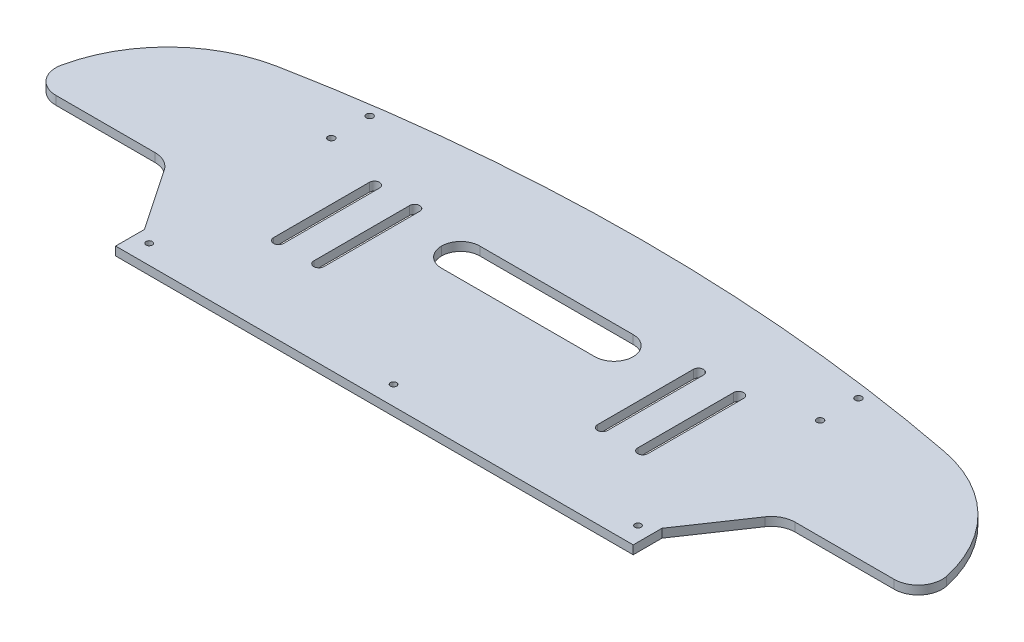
ISO-10303-21;
HEADER;
FILE_DESCRIPTION(('STEP AP214'),'2;1');
FILE_NAME('part.step','',(''),(''),'','','');
FILE_SCHEMA(('AUTOMOTIVE_DESIGN { 1 0 10303 214 1 1 1 1 }'));
ENDSEC;
DATA;
#1=APPLICATION_CONTEXT('core data for automotive mechanical design processes');
#2=APPLICATION_PROTOCOL_DEFINITION('international standard','automotive_design',2000,#1);
#3=PRODUCT_CONTEXT('',#1,'mechanical');
#4=PRODUCT('Part','Part','',(#3));
#5=PRODUCT_RELATED_PRODUCT_CATEGORY('part','',(#4));
#6=PRODUCT_DEFINITION_FORMATION('','',#4);
#7=PRODUCT_DEFINITION_CONTEXT('part definition',#1,'design');
#8=PRODUCT_DEFINITION('design','',#6,#7);
#9=PRODUCT_DEFINITION_SHAPE('','',#8);
#10=(LENGTH_UNIT() NAMED_UNIT(*) SI_UNIT(.MILLI.,.METRE.));
#11=(NAMED_UNIT(*) PLANE_ANGLE_UNIT() SI_UNIT($,.RADIAN.));
#12=(NAMED_UNIT(*) SI_UNIT($,.STERADIAN.) SOLID_ANGLE_UNIT());
#13=UNCERTAINTY_MEASURE_WITH_UNIT(LENGTH_MEASURE(1.E-05),#10,'distance_accuracy_value','');
#14=(GEOMETRIC_REPRESENTATION_CONTEXT(3) GLOBAL_UNCERTAINTY_ASSIGNED_CONTEXT((#13)) GLOBAL_UNIT_ASSIGNED_CONTEXT((#10,
#11,#12)) REPRESENTATION_CONTEXT('',''));
#15=CARTESIAN_POINT('',(0.,0.,0.));
#16=DIRECTION('',(0.,0.,1.));
#17=DIRECTION('',(1.,0.,0.));
#18=AXIS2_PLACEMENT_3D('',#15,#16,#17);
#19=CARTESIAN_POINT('',(-190.,9.,-220.));
#20=DIRECTION('',(0.,-1.,0.));
#21=DIRECTION('',(0.,0.,-1.));
#22=AXIS2_PLACEMENT_3D('',#19,#20,#21);
#23=CYLINDRICAL_SURFACE('',#22,5.24999999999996);
#24=CARTESIAN_POINT('',(-190.,0.,-220.));
#25=DIRECTION('',(0.,1.,0.));
#26=DIRECTION('',(0.,0.,1.));
#27=AXIS2_PLACEMENT_3D('',#24,#25,#26);
#28=CIRCLE('',#27,5.24999999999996);
#29=CARTESIAN_POINT('',(-195.25,0.,-220.));
#30=VERTEX_POINT('',#29);
#31=CARTESIAN_POINT('',(-184.75,0.,-220.));
#32=VERTEX_POINT('',#31);
#33=EDGE_CURVE('E572',#30,#32,#28,.T.);
#34=ORIENTED_EDGE('',*,*,#33,.F.);
#35=DIRECTION('',(0.,-1.,0.));
#36=VECTOR('',#35,1.);
#37=CARTESIAN_POINT('',(-195.25,9.,-220.));
#38=LINE('',#37,#36);
#39=CARTESIAN_POINT('',(-195.25,9.,-220.));
#40=VERTEX_POINT('',#39);
#41=EDGE_CURVE('E605',#40,#30,#38,.T.);
#42=ORIENTED_EDGE('',*,*,#41,.F.);
#43=CARTESIAN_POINT('',(-190.,9.,-220.));
#44=DIRECTION('',(0.,1.,0.));
#45=DIRECTION('',(0.,0.,1.));
#46=AXIS2_PLACEMENT_3D('',#43,#44,#45);
#47=CIRCLE('',#46,5.24999999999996);
#48=CARTESIAN_POINT('',(-184.75,9.,-220.));
#49=VERTEX_POINT('',#48);
#50=EDGE_CURVE('E496',#40,#49,#47,.T.);
#51=ORIENTED_EDGE('',*,*,#50,.T.);
#52=DIRECTION('',(0.,-1.,0.));
#53=VECTOR('',#52,1.);
#54=CARTESIAN_POINT('',(-184.75,9.,-220.));
#55=LINE('',#54,#53);
#56=EDGE_CURVE('E595',#49,#32,#55,.T.);
#57=ORIENTED_EDGE('',*,*,#56,.T.);
#58=EDGE_LOOP('',(#34,#42,#51,#57));
#59=FACE_BOUND('',#58,.T.);
#60=ADVANCED_FACE('F47',(#59),#23,.F.);
#61=CARTESIAN_POINT('',(-195.25,9.,1.08385522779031E-13));
#62=DIRECTION('',(1.,0.,0.));
#63=DIRECTION('',(0.,0.,-1.));
#64=AXIS2_PLACEMENT_3D('',#61,#62,#63);
#65=PLANE('',#64);
#66=DIRECTION('',(0.,0.,1.));
#67=VECTOR('',#66,1.);
#68=CARTESIAN_POINT('',(-195.25,0.,1.08385522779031E-13));
#69=LINE('',#68,#67);
#70=CARTESIAN_POINT('',(-195.25,0.,-320.));
#71=VERTEX_POINT('',#70);
#72=EDGE_CURVE('E576',#71,#30,#69,.T.);
#73=ORIENTED_EDGE('',*,*,#72,.F.);
#74=DIRECTION('',(0.,-1.,0.));
#75=VECTOR('',#74,1.);
#76=CARTESIAN_POINT('',(-195.25,9.,-320.));
#77=LINE('',#76,#75);
#78=CARTESIAN_POINT('',(-195.25,9.,-320.));
#79=VERTEX_POINT('',#78);
#80=EDGE_CURVE('E602',#79,#71,#77,.T.);
#81=ORIENTED_EDGE('',*,*,#80,.F.);
#82=DIRECTION('',(0.,0.,1.));
#83=VECTOR('',#82,1.);
#84=CARTESIAN_POINT('',(-195.25,9.,1.08385522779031E-13));
#85=LINE('',#84,#83);
#86=EDGE_CURVE('E500',#79,#40,#85,.T.);
#87=ORIENTED_EDGE('',*,*,#86,.T.);
#88=ORIENTED_EDGE('',*,*,#41,.T.);
#89=EDGE_LOOP('',(#73,#81,#87,#88));
#90=FACE_BOUND('',#89,.T.);
#91=ADVANCED_FACE('F775',(#90),#65,.T.);
#92=CARTESIAN_POINT('',(-190.,9.,-320.));
#93=DIRECTION('',(0.,-1.,0.));
#94=DIRECTION('',(0.,0.,-1.));
#95=AXIS2_PLACEMENT_3D('',#92,#93,#94);
#96=CYLINDRICAL_SURFACE('',#95,5.25);
#97=CARTESIAN_POINT('',(-190.,0.,-320.));
#98=DIRECTION('',(0.,1.,0.));
#99=DIRECTION('',(0.,0.,1.));
#100=AXIS2_PLACEMENT_3D('',#97,#98,#99);
#101=CIRCLE('',#100,5.25);
#102=CARTESIAN_POINT('',(-184.75,0.,-320.));
#103=VERTEX_POINT('',#102);
#104=EDGE_CURVE('E580',#103,#71,#101,.T.);
#105=ORIENTED_EDGE('',*,*,#104,.F.);
#106=DIRECTION('',(0.,-1.,0.));
#107=VECTOR('',#106,1.);
#108=CARTESIAN_POINT('',(-184.75,9.,-320.));
#109=LINE('',#108,#107);
#110=CARTESIAN_POINT('',(-184.75,9.,-320.));
#111=VERTEX_POINT('',#110);
#112=EDGE_CURVE('E598',#111,#103,#109,.T.);
#113=ORIENTED_EDGE('',*,*,#112,.F.);
#114=CARTESIAN_POINT('',(-190.,9.,-320.));
#115=DIRECTION('',(0.,1.,0.));
#116=DIRECTION('',(0.,0.,1.));
#117=AXIS2_PLACEMENT_3D('',#114,#115,#116);
#118=CIRCLE('',#117,5.25);
#119=EDGE_CURVE('E504',#111,#79,#118,.T.);
#120=ORIENTED_EDGE('',*,*,#119,.T.);
#121=ORIENTED_EDGE('',*,*,#80,.T.);
#122=EDGE_LOOP('',(#105,#113,#120,#121));
#123=FACE_BOUND('',#122,.T.);
#124=ADVANCED_FACE('F781',(#123),#96,.F.);
#125=CARTESIAN_POINT('',(-148.,9.,-220.));
#126=DIRECTION('',(0.,-1.,0.));
#127=DIRECTION('',(0.,0.,-1.));
#128=AXIS2_PLACEMENT_3D('',#125,#126,#127);
#129=CYLINDRICAL_SURFACE('',#128,5.24999999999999);
#130=CARTESIAN_POINT('',(-148.,0.,-220.));
#131=DIRECTION('',(0.,1.,0.));
#132=DIRECTION('',(0.,0.,1.));
#133=AXIS2_PLACEMENT_3D('',#130,#131,#132);
#134=CIRCLE('',#133,5.24999999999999);
#135=CARTESIAN_POINT('',(-153.25,0.,-220.));
#136=VERTEX_POINT('',#135);
#137=CARTESIAN_POINT('',(-142.75,0.,-220.));
#138=VERTEX_POINT('',#137);
#139=EDGE_CURVE('E556',#136,#138,#134,.T.);
#140=ORIENTED_EDGE('',*,*,#139,.F.);
#141=DIRECTION('',(0.,-1.,0.));
#142=VECTOR('',#141,1.);
#143=CARTESIAN_POINT('',(-153.25,9.,-220.));
#144=LINE('',#143,#142);
#145=CARTESIAN_POINT('',(-153.25,9.,-220.));
#146=VERTEX_POINT('',#145);
#147=EDGE_CURVE('E599',#146,#136,#144,.T.);
#148=ORIENTED_EDGE('',*,*,#147,.F.);
#149=CARTESIAN_POINT('',(-148.,9.,-220.));
#150=DIRECTION('',(0.,1.,0.));
#151=DIRECTION('',(0.,0.,1.));
#152=AXIS2_PLACEMENT_3D('',#149,#150,#151);
#153=CIRCLE('',#152,5.24999999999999);
#154=CARTESIAN_POINT('',(-142.75,9.,-220.));
#155=VERTEX_POINT('',#154);
#156=EDGE_CURVE('E481',#146,#155,#153,.T.);
#157=ORIENTED_EDGE('',*,*,#156,.T.);
#158=DIRECTION('',(0.,-1.,0.));
#159=VECTOR('',#158,1.);
#160=CARTESIAN_POINT('',(-142.75,9.,-220.));
#161=LINE('',#160,#159);
#162=EDGE_CURVE('E609',#155,#138,#161,.T.);
#163=ORIENTED_EDGE('',*,*,#162,.T.);
#164=EDGE_LOOP('',(#140,#148,#157,#163));
#165=FACE_BOUND('',#164,.T.);
#166=ADVANCED_FACE('F799',(#165),#129,.F.);
#167=CARTESIAN_POINT('',(-153.25,9.,0.));
#168=DIRECTION('',(1.,0.,0.));
#169=DIRECTION('',(0.,0.,-1.));
#170=AXIS2_PLACEMENT_3D('',#167,#168,#169);
#171=PLANE('',#170);
#172=DIRECTION('',(0.,0.,1.));
#173=VECTOR('',#172,1.);
#174=CARTESIAN_POINT('',(-153.25,0.,0.));
#175=LINE('',#174,#173);
#176=CARTESIAN_POINT('',(-153.25,0.,-320.));
#177=VERTEX_POINT('',#176);
#178=EDGE_CURVE('E560',#177,#136,#175,.T.);
#179=ORIENTED_EDGE('',*,*,#178,.F.);
#180=DIRECTION('',(0.,-1.,0.));
#181=VECTOR('',#180,1.);
#182=CARTESIAN_POINT('',(-153.25,9.,-320.));
#183=LINE('',#182,#181);
#184=CARTESIAN_POINT('',(-153.25,9.,-320.));
#185=VERTEX_POINT('',#184);
#186=EDGE_CURVE('E616',#185,#177,#183,.T.);
#187=ORIENTED_EDGE('',*,*,#186,.F.);
#188=DIRECTION('',(0.,0.,1.));
#189=VECTOR('',#188,1.);
#190=CARTESIAN_POINT('',(-153.25,9.,0.));
#191=LINE('',#190,#189);
#192=EDGE_CURVE('E485',#185,#146,#191,.T.);
#193=ORIENTED_EDGE('',*,*,#192,.T.);
#194=ORIENTED_EDGE('',*,*,#147,.T.);
#195=EDGE_LOOP('',(#179,#187,#193,#194));
#196=FACE_BOUND('',#195,.T.);
#197=ADVANCED_FACE('F795',(#196),#171,.T.);
#198=CARTESIAN_POINT('',(-148.,9.,-320.));
#199=DIRECTION('',(0.,-1.,0.));
#200=DIRECTION('',(0.,0.,-1.));
#201=AXIS2_PLACEMENT_3D('',#198,#199,#200);
#202=CYLINDRICAL_SURFACE('',#201,5.25);
#203=CARTESIAN_POINT('',(-148.,0.,-320.));
#204=DIRECTION('',(0.,1.,0.));
#205=DIRECTION('',(0.,0.,1.));
#206=AXIS2_PLACEMENT_3D('',#203,#204,#205);
#207=CIRCLE('',#206,5.25);
#208=CARTESIAN_POINT('',(-142.75,0.,-320.));
#209=VERTEX_POINT('',#208);
#210=EDGE_CURVE('E564',#209,#177,#207,.T.);
#211=ORIENTED_EDGE('',*,*,#210,.F.);
#212=DIRECTION('',(0.,-1.,0.));
#213=VECTOR('',#212,1.);
#214=CARTESIAN_POINT('',(-142.75,9.,-320.));
#215=LINE('',#214,#213);
#216=CARTESIAN_POINT('',(-142.75,9.,-320.));
#217=VERTEX_POINT('',#216);
#218=EDGE_CURVE('E612',#217,#209,#215,.T.);
#219=ORIENTED_EDGE('',*,*,#218,.F.);
#220=CARTESIAN_POINT('',(-148.,9.,-320.));
#221=DIRECTION('',(0.,1.,0.));
#222=DIRECTION('',(0.,0.,1.));
#223=AXIS2_PLACEMENT_3D('',#220,#221,#222);
#224=CIRCLE('',#223,5.25);
#225=EDGE_CURVE('E489',#217,#185,#224,.T.);
#226=ORIENTED_EDGE('',*,*,#225,.T.);
#227=ORIENTED_EDGE('',*,*,#186,.T.);
#228=EDGE_LOOP('',(#211,#219,#226,#227));
#229=FACE_BOUND('',#228,.T.);
#230=ADVANCED_FACE('F793',(#229),#202,.F.);
#231=CARTESIAN_POINT('',(0.,9.,1422.50000000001));
#232=DIRECTION('',(0.,-1.,0.));
#233=DIRECTION('',(0.,0.,-1.));
#234=AXIS2_PLACEMENT_3D('',#231,#232,#233);
#235=CYLINDRICAL_SURFACE('',#234,1832.50000000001);
#236=CARTESIAN_POINT('',(0.,0.,1422.50000000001));
#237=DIRECTION('',(0.,1.,0.));
#238=DIRECTION('',(0.,0.,1.));
#239=AXIS2_PLACEMENT_3D('',#236,#237,#238);
#240=CIRCLE('',#239,1832.50000000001);
#241=CARTESIAN_POINT('',(-348.155602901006,0.,-376.623099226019));
#242=VERTEX_POINT('',#241);
#243=CARTESIAN_POINT('',(348.155602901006,0.,-376.623099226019));
#244=VERTEX_POINT('',#243);
#245=EDGE_CURVE('E524',#242,#244,#240,.F.);
#246=ORIENTED_EDGE('',*,*,#245,.F.);
#247=DIRECTION('',(0.,-1.,0.));
#248=VECTOR('',#247,1.);
#249=CARTESIAN_POINT('',(-348.155602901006,9.,-376.623099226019));
#250=LINE('',#249,#248);
#251=CARTESIAN_POINT('',(-348.155602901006,9.,-376.623099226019));
#252=VERTEX_POINT('',#251);
#253=EDGE_CURVE('E613',#252,#242,#250,.T.);
#254=ORIENTED_EDGE('',*,*,#253,.F.);
#255=CARTESIAN_POINT('',(0.,9.,1422.50000000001));
#256=DIRECTION('',(0.,1.,0.));
#257=DIRECTION('',(0.,0.,1.));
#258=AXIS2_PLACEMENT_3D('',#255,#256,#257);
#259=CIRCLE('',#258,1832.50000000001);
#260=CARTESIAN_POINT('',(348.155602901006,9.,-376.623099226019));
#261=VERTEX_POINT('',#260);
#262=EDGE_CURVE('E453',#252,#261,#259,.F.);
#263=ORIENTED_EDGE('',*,*,#262,.T.);
#264=DIRECTION('',(0.,-1.,0.));
#265=VECTOR('',#264,1.);
#266=CARTESIAN_POINT('',(348.155602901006,9.,-376.623099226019));
#267=LINE('',#266,#265);
#268=EDGE_CURVE('E361',#261,#244,#267,.T.);
#269=ORIENTED_EDGE('',*,*,#268,.T.);
#270=EDGE_LOOP('',(#246,#254,#263,#269));
#271=FACE_BOUND('',#270,.T.);
#272=ADVANCED_FACE('F739',(#271),#235,.T.);
#273=CARTESIAN_POINT('',(-320.749542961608,9.,-235.));
#274=DIRECTION('',(0.,-1.,0.));
#275=DIRECTION('',(0.,0.,-1.));
#276=AXIS2_PLACEMENT_3D('',#273,#274,#275);
#277=CYLINDRICAL_SURFACE('',#276,144.250457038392);
#278=CARTESIAN_POINT('',(-320.749542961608,0.,-235.));
#279=DIRECTION('',(0.,1.,0.));
#280=DIRECTION('',(0.,0.,1.));
#281=AXIS2_PLACEMENT_3D('',#278,#279,#280);
#282=CIRCLE('',#281,144.250457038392);
#283=CARTESIAN_POINT('',(-461.794472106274,0.,-265.241070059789));
#284=VERTEX_POINT('',#283);
#285=EDGE_CURVE('E528',#284,#242,#282,.F.);
#286=ORIENTED_EDGE('',*,*,#285,.F.);
#287=DIRECTION('',(0.,-1.,0.));
#288=VECTOR('',#287,1.);
#289=CARTESIAN_POINT('',(-461.794472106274,9.,-265.241070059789));
#290=LINE('',#289,#288);
#291=CARTESIAN_POINT('',(-461.794472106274,9.,-265.241070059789));
#292=VERTEX_POINT('',#291);
#293=EDGE_CURVE('E665',#284,#292,#290,.F.);
#294=ORIENTED_EDGE('',*,*,#293,.T.);
#295=CARTESIAN_POINT('',(-320.749542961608,9.,-235.));
#296=DIRECTION('',(0.,1.,0.));
#297=DIRECTION('',(0.,0.,1.));
#298=AXIS2_PLACEMENT_3D('',#295,#296,#297);
#299=CIRCLE('',#298,144.250457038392);
#300=EDGE_CURVE('E458',#292,#252,#299,.F.);
#301=ORIENTED_EDGE('',*,*,#300,.T.);
#302=ORIENTED_EDGE('',*,*,#253,.T.);
#303=EDGE_LOOP('',(#286,#294,#301,#302));
#304=FACE_BOUND('',#303,.T.);
#305=ADVANCED_FACE('F1033',(#304),#277,.T.);
#306=CARTESIAN_POINT('',(5.87819860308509E-13,9.,-234.999999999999));
#307=DIRECTION('',(0.,0.,1.));
#308=DIRECTION('',(1.,0.,0.));
#309=AXIS2_PLACEMENT_3D('',#306,#307,#308);
#310=PLANE('',#309);
#311=DIRECTION('',(-1.,0.,0.));
#312=VECTOR('',#311,1.);
#313=CARTESIAN_POINT('',(5.87819860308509E-13,0.,-234.999999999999));
#314=LINE('',#313,#312);
#315=CARTESIAN_POINT('',(-334.018595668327,0.,-235.));
#316=VERTEX_POINT('',#315);
#317=CARTESIAN_POINT('',(-437.350021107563,0.,-235.));
#318=VERTEX_POINT('',#317);
#319=EDGE_CURVE('E531',#316,#318,#314,.T.);
#320=ORIENTED_EDGE('',*,*,#319,.F.);
#321=DIRECTION('',(0.,-1.,0.));
#322=VECTOR('',#321,1.);
#323=CARTESIAN_POINT('',(-334.018595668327,9.,-235.));
#324=LINE('',#323,#322);
#325=CARTESIAN_POINT('',(-334.018595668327,9.,-235.));
#326=VERTEX_POINT('',#325);
#327=EDGE_CURVE('E659',#316,#326,#324,.F.);
#328=ORIENTED_EDGE('',*,*,#327,.T.);
#329=DIRECTION('',(-1.,0.,0.));
#330=VECTOR('',#329,1.);
#331=CARTESIAN_POINT('',(5.87819860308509E-13,9.,-234.999999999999));
#332=LINE('',#331,#330);
#333=CARTESIAN_POINT('',(-437.350021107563,9.,-235.));
#334=VERTEX_POINT('',#333);
#335=EDGE_CURVE('E461',#326,#334,#332,.T.);
#336=ORIENTED_EDGE('',*,*,#335,.T.);
#337=DIRECTION('',(0.,-1.,0.));
#338=VECTOR('',#337,1.);
#339=CARTESIAN_POINT('',(-437.350021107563,9.,-235.));
#340=LINE('',#339,#338);
#341=EDGE_CURVE('E655',#334,#318,#340,.T.);
#342=ORIENTED_EDGE('',*,*,#341,.T.);
#343=EDGE_LOOP('',(#320,#328,#336,#342));
#344=FACE_BOUND('',#343,.T.);
#345=ADVANCED_FACE('F751',(#344),#310,.T.);
#346=CARTESIAN_POINT('',(-110.938808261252,9.,75.0679175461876));
#347=DIRECTION('',(-0.828210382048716,0.,0.560417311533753));
#348=DIRECTION('',(0.560417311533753,0.,0.828210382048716));
#349=AXIS2_PLACEMENT_3D('',#346,#347,#348);
#350=PLANE('',#349);
#351=DIRECTION('',(-0.560417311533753,0.,-0.828210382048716));
#352=VECTOR('',#351,1.);
#353=CARTESIAN_POINT('',(-110.938808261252,9.,75.0679175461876));
#354=LINE('',#353,#352);
#355=CARTESIAN_POINT('',(-270.,9.,-160.));
#356=VERTEX_POINT('',#355);
#357=CARTESIAN_POINT('',(-313.313336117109,9.,-224.010432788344));
#358=VERTEX_POINT('',#357);
#359=EDGE_CURVE('E465',#356,#358,#354,.T.);
#360=ORIENTED_EDGE('',*,*,#359,.T.);
#361=DIRECTION('',(0.,-1.,0.));
#362=VECTOR('',#361,1.);
#363=CARTESIAN_POINT('',(-313.313336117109,0.,-224.010432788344));
#364=LINE('',#363,#362);
#365=CARTESIAN_POINT('',(-313.313336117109,0.,-224.010432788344));
#366=VERTEX_POINT('',#365);
#367=EDGE_CURVE('E648',#358,#366,#364,.T.);
#368=ORIENTED_EDGE('',*,*,#367,.T.);
#369=DIRECTION('',(-0.560417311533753,0.,-0.828210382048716));
#370=VECTOR('',#369,1.);
#371=CARTESIAN_POINT('',(-110.938808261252,0.,75.0679175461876));
#372=LINE('',#371,#370);
#373=CARTESIAN_POINT('',(-270.,0.,-160.));
#374=VERTEX_POINT('',#373);
#375=EDGE_CURVE('E535',#374,#366,#372,.T.);
#376=ORIENTED_EDGE('',*,*,#375,.F.);
#377=DIRECTION('',(0.,-1.,0.));
#378=VECTOR('',#377,1.);
#379=CARTESIAN_POINT('',(-270.,9.,-160.));
#380=LINE('',#379,#378);
#381=EDGE_CURVE('E623',#356,#374,#380,.T.);
#382=ORIENTED_EDGE('',*,*,#381,.F.);
#383=EDGE_LOOP('',(#360,#368,#376,#382));
#384=FACE_BOUND('',#383,.T.);
#385=ADVANCED_FACE('F759',(#384),#350,.T.);
#386=CARTESIAN_POINT('',(-270.,9.,0.));
#387=DIRECTION('',(-1.,0.,0.));
#388=DIRECTION('',(0.,0.,1.));
#389=AXIS2_PLACEMENT_3D('',#386,#387,#388);
#390=PLANE('',#389);
#391=DIRECTION('',(0.,0.,-1.));
#392=VECTOR('',#391,1.);
#393=CARTESIAN_POINT('',(-270.,0.,0.));
#394=LINE('',#393,#392);
#395=CARTESIAN_POINT('',(-270.,0.,-130.));
#396=VERTEX_POINT('',#395);
#397=EDGE_CURVE('E539',#396,#374,#394,.T.);
#398=ORIENTED_EDGE('',*,*,#397,.F.);
#399=DIRECTION('',(0.,-1.,0.));
#400=VECTOR('',#399,1.);
#401=CARTESIAN_POINT('',(-270.,9.,-130.));
#402=LINE('',#401,#400);
#403=CARTESIAN_POINT('',(-270.,9.,-130.));
#404=VERTEX_POINT('',#403);
#405=EDGE_CURVE('E519',#404,#396,#402,.T.);
#406=ORIENTED_EDGE('',*,*,#405,.F.);
#407=DIRECTION('',(0.,0.,-1.));
#408=VECTOR('',#407,1.);
#409=CARTESIAN_POINT('',(-270.,9.,0.));
#410=LINE('',#409,#408);
#411=EDGE_CURVE('E291',#404,#356,#410,.T.);
#412=ORIENTED_EDGE('',*,*,#411,.T.);
#413=ORIENTED_EDGE('',*,*,#381,.T.);
#414=EDGE_LOOP('',(#398,#406,#412,#413));
#415=FACE_BOUND('',#414,.T.);
#416=ADVANCED_FACE('F762',(#415),#390,.T.);
#417=CARTESIAN_POINT('',(0.,9.,-130.));
#418=DIRECTION('',(0.,0.,-1.));
#419=DIRECTION('',(-1.,0.,0.));
#420=AXIS2_PLACEMENT_3D('',#417,#418,#419);
#421=PLANE('',#420);
#422=DIRECTION('',(1.,0.,0.));
#423=VECTOR('',#422,1.);
#424=CARTESIAN_POINT('',(0.,0.,-130.));
#425=LINE('',#424,#423);
#426=CARTESIAN_POINT('',(270.,0.,-130.));
#427=VERTEX_POINT('',#426);
#428=EDGE_CURVE('E300',#396,#427,#425,.T.);
#429=ORIENTED_EDGE('',*,*,#428,.T.);
#430=DIRECTION('',(0.,-1.,0.));
#431=VECTOR('',#430,1.);
#432=CARTESIAN_POINT('',(270.,9.,-130.));
#433=LINE('',#432,#431);
#434=CARTESIAN_POINT('',(270.,9.,-130.));
#435=VERTEX_POINT('',#434);
#436=EDGE_CURVE('E297',#435,#427,#433,.T.);
#437=ORIENTED_EDGE('',*,*,#436,.F.);
#438=DIRECTION('',(1.,0.,0.));
#439=VECTOR('',#438,1.);
#440=CARTESIAN_POINT('',(0.,9.,-130.));
#441=LINE('',#440,#439);
#442=EDGE_CURVE('E281',#404,#435,#441,.T.);
#443=ORIENTED_EDGE('',*,*,#442,.F.);
#444=ORIENTED_EDGE('',*,*,#405,.T.);
#445=EDGE_LOOP('',(#429,#437,#443,#444));
#446=FACE_BOUND('',#445,.T.);
#447=ADVANCED_FACE('F298',(#446),#421,.F.);
#448=CARTESIAN_POINT('',(0.,9.,-150.));
#449=DIRECTION('',(0.,-1.,0.));
#450=DIRECTION('',(0.,0.,-1.));
#451=AXIS2_PLACEMENT_3D('',#448,#449,#450);
#452=CYLINDRICAL_SURFACE('',#451,3.25000000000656);
#453=CARTESIAN_POINT('',(0.,0.,-150.));
#454=DIRECTION('',(0.,1.,0.));
#455=DIRECTION('',(0.,0.,1.));
#456=AXIS2_PLACEMENT_3D('',#453,#454,#455);
#457=CIRCLE('',#456,3.25000000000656);
#458=CARTESIAN_POINT('',(0.,0.,-146.749999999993));
#459=VERTEX_POINT('',#458);
#460=EDGE_CURVE('E545',#459,#459,#457,.T.);
#461=ORIENTED_EDGE('',*,*,#460,.F.);
#462=EDGE_LOOP('',(#461));
#463=FACE_BOUND('',#462,.T.);
#464=CARTESIAN_POINT('',(0.,9.,-150.));
#465=DIRECTION('',(0.,1.,0.));
#466=DIRECTION('',(0.,0.,1.));
#467=AXIS2_PLACEMENT_3D('',#464,#465,#466);
#468=CIRCLE('',#467,3.25000000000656);
#469=CARTESIAN_POINT('',(0.,9.,-146.749999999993));
#470=VERTEX_POINT('',#469);
#471=EDGE_CURVE('E294',#470,#470,#468,.T.);
#472=ORIENTED_EDGE('',*,*,#471,.T.);
#473=EDGE_LOOP('',(#472));
#474=FACE_BOUND('',#473,.T.);
#475=ADVANCED_FACE('F770',(#463,#474),#452,.F.);
#476=CARTESIAN_POINT('',(0.,9.,-280.));
#477=DIRECTION('',(0.,0.,-1.));
#478=DIRECTION('',(-1.,0.,0.));
#479=AXIS2_PLACEMENT_3D('',#476,#477,#478);
#480=PLANE('',#479);
#481=DIRECTION('',(1.,0.,0.));
#482=VECTOR('',#481,1.);
#483=CARTESIAN_POINT('',(0.,9.,-280.));
#484=LINE('',#483,#482);
#485=CARTESIAN_POINT('',(-80.0000000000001,9.,-280.));
#486=VERTEX_POINT('',#485);
#487=CARTESIAN_POINT('',(80.0000000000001,9.,-280.));
#488=VERTEX_POINT('',#487);
#489=EDGE_CURVE('E474',#486,#488,#484,.T.);
#490=ORIENTED_EDGE('',*,*,#489,.T.);
#491=DIRECTION('',(0.,-1.,0.));
#492=VECTOR('',#491,1.);
#493=CARTESIAN_POINT('',(80.0000000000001,9.,-280.));
#494=LINE('',#493,#492);
#495=CARTESIAN_POINT('',(80.0000000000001,0.,-280.));
#496=VERTEX_POINT('',#495);
#497=EDGE_CURVE('E681',#488,#496,#494,.T.);
#498=ORIENTED_EDGE('',*,*,#497,.T.);
#499=DIRECTION('',(1.,0.,0.));
#500=VECTOR('',#499,1.);
#501=CARTESIAN_POINT('',(0.,0.,-280.));
#502=LINE('',#501,#500);
#503=CARTESIAN_POINT('',(-80.0000000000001,0.,-280.));
#504=VERTEX_POINT('',#503);
#505=EDGE_CURVE('E549',#504,#496,#502,.T.);
#506=ORIENTED_EDGE('',*,*,#505,.F.);
#507=DIRECTION('',(0.,-1.,0.));
#508=VECTOR('',#507,1.);
#509=CARTESIAN_POINT('',(-80.0000000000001,9.,-280.));
#510=LINE('',#509,#508);
#511=EDGE_CURVE('E632',#504,#486,#510,.F.);
#512=ORIENTED_EDGE('',*,*,#511,.T.);
#513=EDGE_LOOP('',(#490,#498,#506,#512));
#514=FACE_BOUND('',#513,.T.);
#515=ADVANCED_FACE('F808',(#514),#480,.T.);
#516=CARTESIAN_POINT('',(0.,9.,-320.));
#517=DIRECTION('',(0.,0.,1.));
#518=DIRECTION('',(1.,0.,0.));
#519=AXIS2_PLACEMENT_3D('',#516,#517,#518);
#520=PLANE('',#519);
#521=DIRECTION('',(-1.,0.,0.));
#522=VECTOR('',#521,1.);
#523=CARTESIAN_POINT('',(0.,0.,-320.));
#524=LINE('',#523,#522);
#525=CARTESIAN_POINT('',(80.0000000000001,0.,-320.));
#526=VERTEX_POINT('',#525);
#527=CARTESIAN_POINT('',(-80.0000000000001,0.,-320.));
#528=VERTEX_POINT('',#527);
#529=EDGE_CURVE('E553',#526,#528,#524,.T.);
#530=ORIENTED_EDGE('',*,*,#529,.F.);
#531=DIRECTION('',(0.,-1.,0.));
#532=VECTOR('',#531,1.);
#533=CARTESIAN_POINT('',(80.0000000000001,9.,-320.));
#534=LINE('',#533,#532);
#535=CARTESIAN_POINT('',(80.0000000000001,9.,-320.));
#536=VERTEX_POINT('',#535);
#537=EDGE_CURVE('E677',#526,#536,#534,.F.);
#538=ORIENTED_EDGE('',*,*,#537,.T.);
#539=DIRECTION('',(-1.,0.,0.));
#540=VECTOR('',#539,1.);
#541=CARTESIAN_POINT('',(0.,9.,-320.));
#542=LINE('',#541,#540);
#543=CARTESIAN_POINT('',(-80.0000000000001,9.,-320.));
#544=VERTEX_POINT('',#543);
#545=EDGE_CURVE('E478',#536,#544,#542,.T.);
#546=ORIENTED_EDGE('',*,*,#545,.T.);
#547=DIRECTION('',(0.,-1.,0.));
#548=VECTOR('',#547,1.);
#549=CARTESIAN_POINT('',(-80.0000000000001,0.,-320.));
#550=LINE('',#549,#548);
#551=EDGE_CURVE('E608',#544,#528,#550,.T.);
#552=ORIENTED_EDGE('',*,*,#551,.T.);
#553=EDGE_LOOP('',(#530,#538,#546,#552));
#554=FACE_BOUND('',#553,.T.);
#555=ADVANCED_FACE('F804',(#554),#520,.T.);
#556=CARTESIAN_POINT('',(-255.,9.,-150.));
#557=DIRECTION('',(0.,-1.,0.));
#558=DIRECTION('',(0.,0.,-1.));
#559=AXIS2_PLACEMENT_3D('',#556,#557,#558);
#560=CYLINDRICAL_SURFACE('',#559,3.25000000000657);
#561=CARTESIAN_POINT('',(-255.,9.,-150.));
#562=DIRECTION('',(0.,1.,0.));
#563=DIRECTION('',(0.,0.,1.));
#564=AXIS2_PLACEMENT_3D('',#561,#562,#563);
#565=CIRCLE('',#564,3.25000000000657);
#566=CARTESIAN_POINT('',(-255.,9.,-146.749999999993));
#567=VERTEX_POINT('',#566);
#568=EDGE_CURVE('E511',#567,#567,#565,.T.);
#569=ORIENTED_EDGE('',*,*,#568,.T.);
#570=EDGE_LOOP('',(#569));
#571=FACE_BOUND('',#570,.T.);
#572=CARTESIAN_POINT('',(-255.,0.,-150.));
#573=DIRECTION('',(0.,1.,0.));
#574=DIRECTION('',(0.,0.,1.));
#575=AXIS2_PLACEMENT_3D('',#572,#573,#574);
#576=CIRCLE('',#575,3.25000000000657);
#577=CARTESIAN_POINT('',(-255.,0.,-146.749999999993));
#578=VERTEX_POINT('',#577);
#579=EDGE_CURVE('E588',#578,#578,#576,.T.);
#580=ORIENTED_EDGE('',*,*,#579,.F.);
#581=EDGE_LOOP('',(#580));
#582=FACE_BOUND('',#581,.T.);
#583=ADVANCED_FACE('F807',(#571,#582),#560,.F.);
#584=CARTESIAN_POINT('',(-184.75,9.,0.));
#585=DIRECTION('',(1.,0.,0.));
#586=DIRECTION('',(0.,0.,-1.));
#587=AXIS2_PLACEMENT_3D('',#584,#585,#586);
#588=PLANE('',#587);
#589=DIRECTION('',(0.,0.,1.));
#590=VECTOR('',#589,1.);
#591=CARTESIAN_POINT('',(-184.75,0.,0.));
#592=LINE('',#591,#590);
#593=EDGE_CURVE('E584',#103,#32,#592,.T.);
#594=ORIENTED_EDGE('',*,*,#593,.T.);
#595=ORIENTED_EDGE('',*,*,#56,.F.);
#596=DIRECTION('',(0.,0.,1.));
#597=VECTOR('',#596,1.);
#598=CARTESIAN_POINT('',(-184.75,9.,0.));
#599=LINE('',#598,#597);
#600=EDGE_CURVE('E508',#111,#49,#599,.T.);
#601=ORIENTED_EDGE('',*,*,#600,.F.);
#602=ORIENTED_EDGE('',*,*,#112,.T.);
#603=EDGE_LOOP('',(#594,#595,#601,#602));
#604=FACE_BOUND('',#603,.T.);
#605=ADVANCED_FACE('F791',(#604),#588,.F.);
#606=CARTESIAN_POINT('',(-142.75,9.,0.));
#607=DIRECTION('',(1.,0.,0.));
#608=DIRECTION('',(0.,0.,-1.));
#609=AXIS2_PLACEMENT_3D('',#606,#607,#608);
#610=PLANE('',#609);
#611=DIRECTION('',(0.,0.,1.));
#612=VECTOR('',#611,1.);
#613=CARTESIAN_POINT('',(-142.75,0.,0.));
#614=LINE('',#613,#612);
#615=EDGE_CURVE('E568',#209,#138,#614,.T.);
#616=ORIENTED_EDGE('',*,*,#615,.T.);
#617=ORIENTED_EDGE('',*,*,#162,.F.);
#618=DIRECTION('',(0.,0.,1.));
#619=VECTOR('',#618,1.);
#620=CARTESIAN_POINT('',(-142.75,9.,0.));
#621=LINE('',#620,#619);
#622=EDGE_CURVE('E493',#217,#155,#621,.T.);
#623=ORIENTED_EDGE('',*,*,#622,.F.);
#624=ORIENTED_EDGE('',*,*,#218,.T.);
#625=EDGE_LOOP('',(#616,#617,#623,#624));
#626=FACE_BOUND('',#625,.T.);
#627=ADVANCED_FACE('F787',(#626),#610,.F.);
#628=CARTESIAN_POINT('',(-255.,9.,-380.));
#629=DIRECTION('',(0.,-1.,0.));
#630=DIRECTION('',(0.,0.,-1.));
#631=AXIS2_PLACEMENT_3D('',#628,#629,#630);
#632=CYLINDRICAL_SURFACE('',#631,3.50000000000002);
#633=CARTESIAN_POINT('',(-255.,9.,-380.));
#634=DIRECTION('',(0.,1.,0.));
#635=DIRECTION('',(0.,0.,1.));
#636=AXIS2_PLACEMENT_3D('',#633,#634,#635);
#637=CIRCLE('',#636,3.50000000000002);
#638=CARTESIAN_POINT('',(-255.,9.,-376.5));
#639=VERTEX_POINT('',#638);
#640=EDGE_CURVE('E449',#639,#639,#637,.T.);
#641=ORIENTED_EDGE('',*,*,#640,.T.);
#642=EDGE_LOOP('',(#641));
#643=FACE_BOUND('',#642,.T.);
#644=CARTESIAN_POINT('',(-255.,0.,-380.));
#645=DIRECTION('',(0.,1.,0.));
#646=DIRECTION('',(0.,0.,1.));
#647=AXIS2_PLACEMENT_3D('',#644,#645,#646);
#648=CIRCLE('',#647,3.50000000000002);
#649=CARTESIAN_POINT('',(-255.,0.,-376.5));
#650=VERTEX_POINT('',#649);
#651=EDGE_CURVE('E520',#650,#650,#648,.T.);
#652=ORIENTED_EDGE('',*,*,#651,.F.);
#653=EDGE_LOOP('',(#652));
#654=FACE_BOUND('',#653,.T.);
#655=ADVANCED_FACE('F790',(#643,#654),#632,.F.);
#656=CARTESIAN_POINT('',(-255.,9.,-340.));
#657=DIRECTION('',(0.,-1.,0.));
#658=DIRECTION('',(0.,0.,-1.));
#659=AXIS2_PLACEMENT_3D('',#656,#657,#658);
#660=CYLINDRICAL_SURFACE('',#659,3.50000000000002);
#661=CARTESIAN_POINT('',(-255.,9.,-340.));
#662=DIRECTION('',(0.,1.,0.));
#663=DIRECTION('',(0.,0.,1.));
#664=AXIS2_PLACEMENT_3D('',#661,#662,#663);
#665=CIRCLE('',#664,3.50000000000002);
#666=CARTESIAN_POINT('',(-255.,9.,-336.5));
#667=VERTEX_POINT('',#666);
#668=EDGE_CURVE('E515',#667,#667,#665,.T.);
#669=ORIENTED_EDGE('',*,*,#668,.T.);
#670=EDGE_LOOP('',(#669));
#671=FACE_BOUND('',#670,.T.);
#672=CARTESIAN_POINT('',(-255.,0.,-340.));
#673=DIRECTION('',(0.,1.,0.));
#674=DIRECTION('',(0.,0.,1.));
#675=AXIS2_PLACEMENT_3D('',#672,#673,#674);
#676=CIRCLE('',#675,3.50000000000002);
#677=CARTESIAN_POINT('',(-255.,0.,-336.5));
#678=VERTEX_POINT('',#677);
#679=EDGE_CURVE('E454',#678,#678,#676,.T.);
#680=ORIENTED_EDGE('',*,*,#679,.F.);
#681=EDGE_LOOP('',(#680));
#682=FACE_BOUND('',#681,.T.);
#683=ADVANCED_FACE('F823',(#671,#682),#660,.F.);
#684=CARTESIAN_POINT('',(0.,9.,0.));
#685=DIRECTION('',(0.,1.,0.));
#686=DIRECTION('',(0.,0.,1.));
#687=AXIS2_PLACEMENT_3D('',#684,#685,#686);
#688=PLANE('',#687);
#689=CARTESIAN_POINT('',(80.0000000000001,9.,-300.));
#690=DIRECTION('',(0.,1.,0.));
#691=DIRECTION('',(0.,0.,1.));
#692=AXIS2_PLACEMENT_3D('',#689,#690,#691);
#693=CIRCLE('',#692,20.);
#694=CARTESIAN_POINT('',(100.,9.,-300.));
#695=VERTEX_POINT('',#694);
#696=EDGE_CURVE('E687',#536,#695,#693,.F.);
#697=ORIENTED_EDGE('',*,*,#696,.T.);
#698=CARTESIAN_POINT('',(80.0000000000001,9.,-300.));
#699=DIRECTION('',(0.,1.,0.));
#700=DIRECTION('',(0.,0.,1.));
#701=AXIS2_PLACEMENT_3D('',#698,#699,#700);
#702=CIRCLE('',#701,20.);
#703=EDGE_CURVE('E693',#695,#488,#702,.F.);
#704=ORIENTED_EDGE('',*,*,#703,.T.);
#705=ORIENTED_EDGE('',*,*,#489,.F.);
#706=CARTESIAN_POINT('',(-80.0000000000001,9.,-300.));
#707=DIRECTION('',(0.,1.,0.));
#708=DIRECTION('',(0.,0.,1.));
#709=AXIS2_PLACEMENT_3D('',#706,#707,#708);
#710=CIRCLE('',#709,20.);
#711=CARTESIAN_POINT('',(-100.,9.,-300.));
#712=VERTEX_POINT('',#711);
#713=EDGE_CURVE('E645',#486,#712,#710,.F.);
#714=ORIENTED_EDGE('',*,*,#713,.T.);
#715=CARTESIAN_POINT('',(-80.0000000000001,9.,-300.));
#716=DIRECTION('',(0.,1.,0.));
#717=DIRECTION('',(0.,0.,1.));
#718=AXIS2_PLACEMENT_3D('',#715,#716,#717);
#719=CIRCLE('',#718,20.);
#720=EDGE_CURVE('E638',#712,#544,#719,.F.);
#721=ORIENTED_EDGE('',*,*,#720,.T.);
#722=ORIENTED_EDGE('',*,*,#545,.F.);
#723=EDGE_LOOP('',(#697,#704,#705,#714,#721,#722));
#724=FACE_BOUND('',#723,.T.);
#725=ORIENTED_EDGE('',*,*,#471,.F.);
#726=EDGE_LOOP('',(#725));
#727=FACE_BOUND('',#726,.T.);
#728=ORIENTED_EDGE('',*,*,#640,.F.);
#729=EDGE_LOOP('',(#728));
#730=FACE_BOUND('',#729,.T.);
#731=DIRECTION('',(1.,0.,0.));
#732=VECTOR('',#731,1.);
#733=CARTESIAN_POINT('',(-5.87819860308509E-13,9.,-234.999999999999));
#734=LINE('',#733,#732);
#735=CARTESIAN_POINT('',(334.018595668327,9.,-235.));
#736=VERTEX_POINT('',#735);
#737=CARTESIAN_POINT('',(437.350021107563,9.,-235.));
#738=VERTEX_POINT('',#737);
#739=EDGE_CURVE('E316',#736,#738,#734,.T.);
#740=ORIENTED_EDGE('',*,*,#739,.T.);
#741=CARTESIAN_POINT('',(437.350021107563,9.,-260.));
#742=DIRECTION('',(0.,1.,0.));
#743=DIRECTION('',(0.,0.,1.));
#744=AXIS2_PLACEMENT_3D('',#741,#742,#743);
#745=CIRCLE('',#744,25.);
#746=CARTESIAN_POINT('',(461.794472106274,9.,-265.241070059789));
#747=VERTEX_POINT('',#746);
#748=EDGE_CURVE('E63',#738,#747,#745,.T.);
#749=ORIENTED_EDGE('',*,*,#748,.T.);
#750=CARTESIAN_POINT('',(320.749542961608,9.,-235.));
#751=DIRECTION('',(0.,-1.,0.));
#752=DIRECTION('',(0.,0.,1.));
#753=AXIS2_PLACEMENT_3D('',#750,#751,#752);
#754=CIRCLE('',#753,144.250457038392);
#755=EDGE_CURVE('E324',#747,#261,#754,.F.);
#756=ORIENTED_EDGE('',*,*,#755,.T.);
#757=ORIENTED_EDGE('',*,*,#262,.F.);
#758=ORIENTED_EDGE('',*,*,#300,.F.);
#759=CARTESIAN_POINT('',(-437.350021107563,9.,-260.));
#760=DIRECTION('',(0.,1.,0.));
#761=DIRECTION('',(0.,0.,1.));
#762=AXIS2_PLACEMENT_3D('',#759,#760,#761);
#763=CIRCLE('',#762,25.);
#764=EDGE_CURVE('E668',#292,#334,#763,.T.);
#765=ORIENTED_EDGE('',*,*,#764,.T.);
#766=ORIENTED_EDGE('',*,*,#335,.F.);
#767=CARTESIAN_POINT('',(-334.018595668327,9.,-210.));
#768=DIRECTION('',(0.,1.,0.));
#769=DIRECTION('',(0.,0.,1.));
#770=AXIS2_PLACEMENT_3D('',#767,#768,#769);
#771=CIRCLE('',#770,25.);
#772=EDGE_CURVE('E674',#326,#358,#771,.F.);
#773=ORIENTED_EDGE('',*,*,#772,.T.);
#774=ORIENTED_EDGE('',*,*,#359,.F.);
#775=ORIENTED_EDGE('',*,*,#411,.F.);
#776=ORIENTED_EDGE('',*,*,#442,.T.);
#777=DIRECTION('',(0.,0.,-1.));
#778=VECTOR('',#777,1.);
#779=CARTESIAN_POINT('',(270.,9.,0.));
#780=LINE('',#779,#778);
#781=CARTESIAN_POINT('',(270.,9.,-160.));
#782=VERTEX_POINT('',#781);
#783=EDGE_CURVE('E287',#435,#782,#780,.T.);
#784=ORIENTED_EDGE('',*,*,#783,.T.);
#785=DIRECTION('',(0.560417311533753,0.,-0.828210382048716));
#786=VECTOR('',#785,1.);
#787=CARTESIAN_POINT('',(110.938808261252,9.,75.0679175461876));
#788=LINE('',#787,#786);
#789=CARTESIAN_POINT('',(313.313336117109,9.,-224.010432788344));
#790=VERTEX_POINT('',#789);
#791=EDGE_CURVE('E311',#782,#790,#788,.T.);
#792=ORIENTED_EDGE('',*,*,#791,.T.);
#793=CARTESIAN_POINT('',(334.018595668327,9.,-210.));
#794=DIRECTION('',(0.,1.,0.));
#795=DIRECTION('',(0.,0.,1.));
#796=AXIS2_PLACEMENT_3D('',#793,#794,#795);
#797=CIRCLE('',#796,25.);
#798=EDGE_CURVE('E11',#790,#736,#797,.F.);
#799=ORIENTED_EDGE('',*,*,#798,.T.);
#800=EDGE_LOOP('',(#740,#749,#756,#757,#758,#765,#766,#773,#774,#775,#776,#784,#792,#799));
#801=FACE_BOUND('',#800,.T.);
#802=ORIENTED_EDGE('',*,*,#156,.F.);
#803=ORIENTED_EDGE('',*,*,#192,.F.);
#804=ORIENTED_EDGE('',*,*,#225,.F.);
#805=ORIENTED_EDGE('',*,*,#622,.T.);
#806=EDGE_LOOP('',(#802,#803,#804,#805));
#807=FACE_BOUND('',#806,.T.);
#808=ORIENTED_EDGE('',*,*,#50,.F.);
#809=ORIENTED_EDGE('',*,*,#86,.F.);
#810=ORIENTED_EDGE('',*,*,#119,.F.);
#811=ORIENTED_EDGE('',*,*,#600,.T.);
#812=EDGE_LOOP('',(#808,#809,#810,#811));
#813=FACE_BOUND('',#812,.T.);
#814=ORIENTED_EDGE('',*,*,#568,.F.);
#815=EDGE_LOOP('',(#814));
#816=FACE_BOUND('',#815,.T.);
#817=ORIENTED_EDGE('',*,*,#668,.F.);
#818=EDGE_LOOP('',(#817));
#819=FACE_BOUND('',#818,.T.);
#820=CARTESIAN_POINT('',(255.,9.,-380.));
#821=DIRECTION('',(0.,-1.,0.));
#822=DIRECTION('',(0.,0.,1.));
#823=AXIS2_PLACEMENT_3D('',#820,#821,#822);
#824=CIRCLE('',#823,3.50000000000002);
#825=CARTESIAN_POINT('',(255.,9.,-376.5));
#826=VERTEX_POINT('',#825);
#827=EDGE_CURVE('E312',#826,#826,#824,.T.);
#828=ORIENTED_EDGE('',*,*,#827,.T.);
#829=EDGE_LOOP('',(#828));
#830=FACE_BOUND('',#829,.T.);
#831=CARTESIAN_POINT('',(148.,9.,-220.));
#832=DIRECTION('',(0.,-1.,0.));
#833=DIRECTION('',(0.,0.,1.));
#834=AXIS2_PLACEMENT_3D('',#831,#832,#833);
#835=CIRCLE('',#834,5.24999999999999);
#836=CARTESIAN_POINT('',(153.25,9.,-220.));
#837=VERTEX_POINT('',#836);
#838=CARTESIAN_POINT('',(142.75,9.,-220.));
#839=VERTEX_POINT('',#838);
#840=EDGE_CURVE('E327',#837,#839,#835,.T.);
#841=ORIENTED_EDGE('',*,*,#840,.T.);
#842=DIRECTION('',(0.,0.,1.));
#843=VECTOR('',#842,1.);
#844=CARTESIAN_POINT('',(142.75,9.,0.));
#845=LINE('',#844,#843);
#846=CARTESIAN_POINT('',(142.75,9.,-320.));
#847=VERTEX_POINT('',#846);
#848=EDGE_CURVE('E330',#847,#839,#845,.T.);
#849=ORIENTED_EDGE('',*,*,#848,.F.);
#850=CARTESIAN_POINT('',(148.,9.,-320.));
#851=DIRECTION('',(0.,-1.,0.));
#852=DIRECTION('',(0.,0.,1.));
#853=AXIS2_PLACEMENT_3D('',#850,#851,#852);
#854=CIRCLE('',#853,5.25);
#855=CARTESIAN_POINT('',(153.25,9.,-320.));
#856=VERTEX_POINT('',#855);
#857=EDGE_CURVE('E334',#847,#856,#854,.T.);
#858=ORIENTED_EDGE('',*,*,#857,.T.);
#859=DIRECTION('',(0.,0.,1.));
#860=VECTOR('',#859,1.);
#861=CARTESIAN_POINT('',(153.25,9.,0.));
#862=LINE('',#861,#860);
#863=EDGE_CURVE('E337',#856,#837,#862,.T.);
#864=ORIENTED_EDGE('',*,*,#863,.T.);
#865=EDGE_LOOP('',(#841,#849,#858,#864));
#866=FACE_BOUND('',#865,.T.);
#867=CARTESIAN_POINT('',(190.,9.,-220.));
#868=DIRECTION('',(0.,-1.,0.));
#869=DIRECTION('',(0.,0.,1.));
#870=AXIS2_PLACEMENT_3D('',#867,#868,#869);
#871=CIRCLE('',#870,5.24999999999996);
#872=CARTESIAN_POINT('',(195.25,9.,-220.));
#873=VERTEX_POINT('',#872);
#874=CARTESIAN_POINT('',(184.75,9.,-220.));
#875=VERTEX_POINT('',#874);
#876=EDGE_CURVE('E340',#873,#875,#871,.T.);
#877=ORIENTED_EDGE('',*,*,#876,.T.);
#878=DIRECTION('',(0.,0.,1.));
#879=VECTOR('',#878,1.);
#880=CARTESIAN_POINT('',(184.75,9.,0.));
#881=LINE('',#880,#879);
#882=CARTESIAN_POINT('',(184.75,9.,-320.));
#883=VERTEX_POINT('',#882);
#884=EDGE_CURVE('E343',#883,#875,#881,.T.);
#885=ORIENTED_EDGE('',*,*,#884,.F.);
#886=CARTESIAN_POINT('',(190.,9.,-320.));
#887=DIRECTION('',(0.,-1.,0.));
#888=DIRECTION('',(0.,0.,1.));
#889=AXIS2_PLACEMENT_3D('',#886,#887,#888);
#890=CIRCLE('',#889,5.25);
#891=CARTESIAN_POINT('',(195.25,9.,-320.));
#892=VERTEX_POINT('',#891);
#893=EDGE_CURVE('E347',#883,#892,#890,.T.);
#894=ORIENTED_EDGE('',*,*,#893,.T.);
#895=DIRECTION('',(0.,0.,1.));
#896=VECTOR('',#895,1.);
#897=CARTESIAN_POINT('',(195.25,9.,1.08385522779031E-13));
#898=LINE('',#897,#896);
#899=EDGE_CURVE('E350',#892,#873,#898,.T.);
#900=ORIENTED_EDGE('',*,*,#899,.T.);
#901=EDGE_LOOP('',(#877,#885,#894,#900));
#902=FACE_BOUND('',#901,.T.);
#903=CARTESIAN_POINT('',(255.,9.,-150.));
#904=DIRECTION('',(0.,-1.,0.));
#905=DIRECTION('',(0.,0.,1.));
#906=AXIS2_PLACEMENT_3D('',#903,#904,#905);
#907=CIRCLE('',#906,3.25000000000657);
#908=CARTESIAN_POINT('',(255.,9.,-146.749999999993));
#909=VERTEX_POINT('',#908);
#910=EDGE_CURVE('E353',#909,#909,#907,.T.);
#911=ORIENTED_EDGE('',*,*,#910,.T.);
#912=EDGE_LOOP('',(#911));
#913=FACE_BOUND('',#912,.T.);
#914=CARTESIAN_POINT('',(255.,9.,-340.));
#915=DIRECTION('',(0.,-1.,0.));
#916=DIRECTION('',(0.,0.,1.));
#917=AXIS2_PLACEMENT_3D('',#914,#915,#916);
#918=CIRCLE('',#917,3.50000000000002);
#919=CARTESIAN_POINT('',(255.,9.,-336.5));
#920=VERTEX_POINT('',#919);
#921=EDGE_CURVE('E357',#920,#920,#918,.T.);
#922=ORIENTED_EDGE('',*,*,#921,.T.);
#923=EDGE_LOOP('',(#922));
#924=FACE_BOUND('',#923,.T.);
#925=ADVANCED_FACE('F283',(#724,#727,#730,#801,#807,#813,#816,#819,#830,#866,#902,#913,#924),
#688,.T.);
#926=CARTESIAN_POINT('',(0.,0.,0.));
#927=DIRECTION('',(0.,1.,0.));
#928=DIRECTION('',(0.,0.,1.));
#929=AXIS2_PLACEMENT_3D('',#926,#927,#928);
#930=PLANE('',#929);
#931=ORIENTED_EDGE('',*,*,#505,.T.);
#932=CARTESIAN_POINT('',(80.0000000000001,0.,-300.));
#933=DIRECTION('',(0.,1.,0.));
#934=DIRECTION('',(0.,0.,1.));
#935=AXIS2_PLACEMENT_3D('',#932,#933,#934);
#936=CIRCLE('',#935,20.);
#937=CARTESIAN_POINT('',(100.,0.,-300.));
#938=VERTEX_POINT('',#937);
#939=EDGE_CURVE('E690',#496,#938,#936,.T.);
#940=ORIENTED_EDGE('',*,*,#939,.T.);
#941=CARTESIAN_POINT('',(80.0000000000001,0.,-300.));
#942=DIRECTION('',(0.,1.,0.));
#943=DIRECTION('',(0.,0.,1.));
#944=AXIS2_PLACEMENT_3D('',#941,#942,#943);
#945=CIRCLE('',#944,20.);
#946=EDGE_CURVE('E684',#938,#526,#945,.T.);
#947=ORIENTED_EDGE('',*,*,#946,.T.);
#948=ORIENTED_EDGE('',*,*,#529,.T.);
#949=CARTESIAN_POINT('',(-80.0000000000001,0.,-300.));
#950=DIRECTION('',(0.,1.,0.));
#951=DIRECTION('',(0.,0.,1.));
#952=AXIS2_PLACEMENT_3D('',#949,#950,#951);
#953=CIRCLE('',#952,20.);
#954=CARTESIAN_POINT('',(-100.,0.,-300.));
#955=VERTEX_POINT('',#954);
#956=EDGE_CURVE('E635',#528,#955,#953,.T.);
#957=ORIENTED_EDGE('',*,*,#956,.T.);
#958=CARTESIAN_POINT('',(-80.0000000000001,0.,-300.));
#959=DIRECTION('',(0.,1.,0.));
#960=DIRECTION('',(0.,0.,1.));
#961=AXIS2_PLACEMENT_3D('',#958,#959,#960);
#962=CIRCLE('',#961,20.);
#963=EDGE_CURVE('E642',#955,#504,#962,.T.);
#964=ORIENTED_EDGE('',*,*,#963,.T.);
#965=EDGE_LOOP('',(#931,#940,#947,#948,#957,#964));
#966=FACE_BOUND('',#965,.T.);
#967=ORIENTED_EDGE('',*,*,#460,.T.);
#968=EDGE_LOOP('',(#967));
#969=FACE_BOUND('',#968,.T.);
#970=ORIENTED_EDGE('',*,*,#651,.T.);
#971=EDGE_LOOP('',(#970));
#972=FACE_BOUND('',#971,.T.);
#973=CARTESIAN_POINT('',(320.749542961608,0.,-235.));
#974=DIRECTION('',(0.,-1.,0.));
#975=DIRECTION('',(0.,0.,1.));
#976=AXIS2_PLACEMENT_3D('',#973,#974,#975);
#977=CIRCLE('',#976,144.250457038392);
#978=CARTESIAN_POINT('',(461.794472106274,0.,-265.241070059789));
#979=VERTEX_POINT('',#978);
#980=EDGE_CURVE('E378',#979,#244,#977,.F.);
#981=ORIENTED_EDGE('',*,*,#980,.F.);
#982=CARTESIAN_POINT('',(437.350021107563,0.,-260.));
#983=DIRECTION('',(0.,1.,0.));
#984=DIRECTION('',(0.,0.,1.));
#985=AXIS2_PLACEMENT_3D('',#982,#983,#984);
#986=CIRCLE('',#985,25.);
#987=CARTESIAN_POINT('',(437.350021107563,0.,-235.));
#988=VERTEX_POINT('',#987);
#989=EDGE_CURVE('E71',#979,#988,#986,.F.);
#990=ORIENTED_EDGE('',*,*,#989,.T.);
#991=DIRECTION('',(1.,0.,0.));
#992=VECTOR('',#991,1.);
#993=CARTESIAN_POINT('',(-5.87819860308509E-13,0.,-234.999999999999));
#994=LINE('',#993,#992);
#995=CARTESIAN_POINT('',(334.018595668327,0.,-235.));
#996=VERTEX_POINT('',#995);
#997=EDGE_CURVE('E374',#996,#988,#994,.T.);
#998=ORIENTED_EDGE('',*,*,#997,.F.);
#999=CARTESIAN_POINT('',(334.018595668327,0.,-210.));
#1000=DIRECTION('',(0.,1.,0.));
#1001=DIRECTION('',(0.,0.,1.));
#1002=AXIS2_PLACEMENT_3D('',#999,#1000,#1001);
#1003=CIRCLE('',#1002,25.);
#1004=CARTESIAN_POINT('',(313.313336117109,0.,-224.010432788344));
#1005=VERTEX_POINT('',#1004);
#1006=EDGE_CURVE('E56',#996,#1005,#1003,.T.);
#1007=ORIENTED_EDGE('',*,*,#1006,.T.);
#1008=DIRECTION('',(0.560417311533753,0.,-0.828210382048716));
#1009=VECTOR('',#1008,1.);
#1010=CARTESIAN_POINT('',(110.938808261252,0.,75.0679175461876));
#1011=LINE('',#1010,#1009);
#1012=CARTESIAN_POINT('',(270.,0.,-160.));
#1013=VERTEX_POINT('',#1012);
#1014=EDGE_CURVE('E370',#1013,#1005,#1011,.T.);
#1015=ORIENTED_EDGE('',*,*,#1014,.F.);
#1016=DIRECTION('',(0.,0.,-1.));
#1017=VECTOR('',#1016,1.);
#1018=CARTESIAN_POINT('',(270.,0.,0.));
#1019=LINE('',#1018,#1017);
#1020=EDGE_CURVE('E366',#427,#1013,#1019,.T.);
#1021=ORIENTED_EDGE('',*,*,#1020,.F.);
#1022=ORIENTED_EDGE('',*,*,#428,.F.);
#1023=ORIENTED_EDGE('',*,*,#397,.T.);
#1024=ORIENTED_EDGE('',*,*,#375,.T.);
#1025=CARTESIAN_POINT('',(-334.018595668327,0.,-210.));
#1026=DIRECTION('',(0.,1.,0.));
#1027=DIRECTION('',(0.,0.,1.));
#1028=AXIS2_PLACEMENT_3D('',#1025,#1026,#1027);
#1029=CIRCLE('',#1028,25.);
#1030=EDGE_CURVE('E671',#366,#316,#1029,.T.);
#1031=ORIENTED_EDGE('',*,*,#1030,.T.);
#1032=ORIENTED_EDGE('',*,*,#319,.T.);
#1033=CARTESIAN_POINT('',(-437.350021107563,0.,-260.));
#1034=DIRECTION('',(0.,1.,0.));
#1035=DIRECTION('',(0.,0.,1.));
#1036=AXIS2_PLACEMENT_3D('',#1033,#1034,#1035);
#1037=CIRCLE('',#1036,25.);
#1038=EDGE_CURVE('E662',#318,#284,#1037,.F.);
#1039=ORIENTED_EDGE('',*,*,#1038,.T.);
#1040=ORIENTED_EDGE('',*,*,#285,.T.);
#1041=ORIENTED_EDGE('',*,*,#245,.T.);
#1042=EDGE_LOOP('',(#981,#990,#998,#1007,#1015,#1021,#1022,#1023,#1024,#1031,#1032,#1039,#1040,#1041));
#1043=FACE_BOUND('',#1042,.T.);
#1044=ORIENTED_EDGE('',*,*,#139,.T.);
#1045=ORIENTED_EDGE('',*,*,#615,.F.);
#1046=ORIENTED_EDGE('',*,*,#210,.T.);
#1047=ORIENTED_EDGE('',*,*,#178,.T.);
#1048=EDGE_LOOP('',(#1044,#1045,#1046,#1047));
#1049=FACE_BOUND('',#1048,.T.);
#1050=ORIENTED_EDGE('',*,*,#33,.T.);
#1051=ORIENTED_EDGE('',*,*,#593,.F.);
#1052=ORIENTED_EDGE('',*,*,#104,.T.);
#1053=ORIENTED_EDGE('',*,*,#72,.T.);
#1054=EDGE_LOOP('',(#1050,#1051,#1052,#1053));
#1055=FACE_BOUND('',#1054,.T.);
#1056=ORIENTED_EDGE('',*,*,#579,.T.);
#1057=EDGE_LOOP('',(#1056));
#1058=FACE_BOUND('',#1057,.T.);
#1059=ORIENTED_EDGE('',*,*,#679,.T.);
#1060=EDGE_LOOP('',(#1059));
#1061=FACE_BOUND('',#1060,.T.);
#1062=CARTESIAN_POINT('',(255.,0.,-380.));
#1063=DIRECTION('',(0.,-1.,0.));
#1064=DIRECTION('',(0.,0.,1.));
#1065=AXIS2_PLACEMENT_3D('',#1062,#1063,#1064);
#1066=CIRCLE('',#1065,3.50000000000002);
#1067=CARTESIAN_POINT('',(255.,0.,-376.5));
#1068=VERTEX_POINT('',#1067);
#1069=EDGE_CURVE('E362',#1068,#1068,#1066,.T.);
#1070=ORIENTED_EDGE('',*,*,#1069,.F.);
#1071=EDGE_LOOP('',(#1070));
#1072=FACE_BOUND('',#1071,.T.);
#1073=CARTESIAN_POINT('',(148.,0.,-220.));
#1074=DIRECTION('',(0.,-1.,0.));
#1075=DIRECTION('',(0.,0.,1.));
#1076=AXIS2_PLACEMENT_3D('',#1073,#1074,#1075);
#1077=CIRCLE('',#1076,5.24999999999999);
#1078=CARTESIAN_POINT('',(153.25,0.,-220.));
#1079=VERTEX_POINT('',#1078);
#1080=CARTESIAN_POINT('',(142.75,0.,-220.));
#1081=VERTEX_POINT('',#1080);
#1082=EDGE_CURVE('E381',#1079,#1081,#1077,.T.);
#1083=ORIENTED_EDGE('',*,*,#1082,.F.);
#1084=DIRECTION('',(0.,0.,1.));
#1085=VECTOR('',#1084,1.);
#1086=CARTESIAN_POINT('',(153.25,0.,0.));
#1087=LINE('',#1086,#1085);
#1088=CARTESIAN_POINT('',(153.25,0.,-320.));
#1089=VERTEX_POINT('',#1088);
#1090=EDGE_CURVE('E392',#1089,#1079,#1087,.T.);
#1091=ORIENTED_EDGE('',*,*,#1090,.F.);
#1092=CARTESIAN_POINT('',(148.,0.,-320.));
#1093=DIRECTION('',(0.,-1.,0.));
#1094=DIRECTION('',(0.,0.,1.));
#1095=AXIS2_PLACEMENT_3D('',#1092,#1093,#1094);
#1096=CIRCLE('',#1095,5.25);
#1097=CARTESIAN_POINT('',(142.75,0.,-320.));
#1098=VERTEX_POINT('',#1097);
#1099=EDGE_CURVE('E389',#1098,#1089,#1096,.T.);
#1100=ORIENTED_EDGE('',*,*,#1099,.F.);
#1101=DIRECTION('',(0.,0.,1.));
#1102=VECTOR('',#1101,1.);
#1103=CARTESIAN_POINT('',(142.75,0.,0.));
#1104=LINE('',#1103,#1102);
#1105=EDGE_CURVE('E385',#1098,#1081,#1104,.T.);
#1106=ORIENTED_EDGE('',*,*,#1105,.T.);
#1107=EDGE_LOOP('',(#1083,#1091,#1100,#1106));
#1108=FACE_BOUND('',#1107,.T.);
#1109=CARTESIAN_POINT('',(190.,0.,-220.));
#1110=DIRECTION('',(0.,-1.,0.));
#1111=DIRECTION('',(0.,0.,1.));
#1112=AXIS2_PLACEMENT_3D('',#1109,#1110,#1111);
#1113=CIRCLE('',#1112,5.24999999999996);
#1114=CARTESIAN_POINT('',(195.25,0.,-220.));
#1115=VERTEX_POINT('',#1114);
#1116=CARTESIAN_POINT('',(184.75,0.,-220.));
#1117=VERTEX_POINT('',#1116);
#1118=EDGE_CURVE('E395',#1115,#1117,#1113,.T.);
#1119=ORIENTED_EDGE('',*,*,#1118,.F.);
#1120=DIRECTION('',(0.,0.,1.));
#1121=VECTOR('',#1120,1.);
#1122=CARTESIAN_POINT('',(195.25,0.,1.08385522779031E-13));
#1123=LINE('',#1122,#1121);
#1124=CARTESIAN_POINT('',(195.25,0.,-320.));
#1125=VERTEX_POINT('',#1124);
#1126=EDGE_CURVE('E406',#1125,#1115,#1123,.T.);
#1127=ORIENTED_EDGE('',*,*,#1126,.F.);
#1128=CARTESIAN_POINT('',(190.,0.,-320.));
#1129=DIRECTION('',(0.,-1.,0.));
#1130=DIRECTION('',(0.,0.,1.));
#1131=AXIS2_PLACEMENT_3D('',#1128,#1129,#1130);
#1132=CIRCLE('',#1131,5.25);
#1133=CARTESIAN_POINT('',(184.75,0.,-320.));
#1134=VERTEX_POINT('',#1133);
#1135=EDGE_CURVE('E403',#1134,#1125,#1132,.T.);
#1136=ORIENTED_EDGE('',*,*,#1135,.F.);
#1137=DIRECTION('',(0.,0.,1.));
#1138=VECTOR('',#1137,1.);
#1139=CARTESIAN_POINT('',(184.75,0.,0.));
#1140=LINE('',#1139,#1138);
#1141=EDGE_CURVE('E399',#1134,#1117,#1140,.T.);
#1142=ORIENTED_EDGE('',*,*,#1141,.T.);
#1143=EDGE_LOOP('',(#1119,#1127,#1136,#1142));
#1144=FACE_BOUND('',#1143,.T.);
#1145=CARTESIAN_POINT('',(255.,0.,-150.));
#1146=DIRECTION('',(0.,-1.,0.));
#1147=DIRECTION('',(0.,0.,1.));
#1148=AXIS2_PLACEMENT_3D('',#1145,#1146,#1147);
#1149=CIRCLE('',#1148,3.25000000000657);
#1150=CARTESIAN_POINT('',(255.,0.,-146.749999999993));
#1151=VERTEX_POINT('',#1150);
#1152=EDGE_CURVE('E409',#1151,#1151,#1149,.T.);
#1153=ORIENTED_EDGE('',*,*,#1152,.F.);
#1154=EDGE_LOOP('',(#1153));
#1155=FACE_BOUND('',#1154,.T.);
#1156=CARTESIAN_POINT('',(255.,0.,-340.));
#1157=DIRECTION('',(0.,-1.,0.));
#1158=DIRECTION('',(0.,0.,1.));
#1159=AXIS2_PLACEMENT_3D('',#1156,#1157,#1158);
#1160=CIRCLE('',#1159,3.50000000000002);
#1161=CARTESIAN_POINT('',(255.,0.,-336.5));
#1162=VERTEX_POINT('',#1161);
#1163=EDGE_CURVE('E319',#1162,#1162,#1160,.T.);
#1164=ORIENTED_EDGE('',*,*,#1163,.F.);
#1165=EDGE_LOOP('',(#1164));
#1166=FACE_BOUND('',#1165,.T.);
#1167=ADVANCED_FACE('F720',(#966,#969,#972,#1043,#1049,#1055,#1058,#1061,#1072,#1108,#1144,
#1155,#1166),#930,.F.);
#1168=CARTESIAN_POINT('',(-80.0000000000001,9.,-300.));
#1169=DIRECTION('',(0.,1.,0.));
#1170=DIRECTION('',(0.,0.,1.));
#1171=AXIS2_PLACEMENT_3D('',#1168,#1169,#1170);
#1172=CYLINDRICAL_SURFACE('',#1171,20.);
#1173=DIRECTION('',(0.,-1.,0.));
#1174=VECTOR('',#1173,1.);
#1175=CARTESIAN_POINT('',(-100.,0.,-300.));
#1176=LINE('',#1175,#1174);
#1177=EDGE_CURVE('E431',#712,#955,#1176,.T.);
#1178=ORIENTED_EDGE('',*,*,#1177,.F.);
#1179=ORIENTED_EDGE('',*,*,#713,.F.);
#1180=ORIENTED_EDGE('',*,*,#511,.F.);
#1181=ORIENTED_EDGE('',*,*,#963,.F.);
#1182=EDGE_LOOP('',(#1178,#1179,#1180,#1181));
#1183=FACE_BOUND('',#1182,.T.);
#1184=ADVANCED_FACE('F834',(#1183),#1172,.F.);
#1185=CARTESIAN_POINT('',(-80.0000000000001,9.,-300.));
#1186=DIRECTION('',(0.,1.,0.));
#1187=DIRECTION('',(0.,0.,1.));
#1188=AXIS2_PLACEMENT_3D('',#1185,#1186,#1187);
#1189=CYLINDRICAL_SURFACE('',#1188,20.);
#1190=ORIENTED_EDGE('',*,*,#720,.F.);
#1191=ORIENTED_EDGE('',*,*,#1177,.T.);
#1192=ORIENTED_EDGE('',*,*,#956,.F.);
#1193=ORIENTED_EDGE('',*,*,#551,.F.);
#1194=EDGE_LOOP('',(#1190,#1191,#1192,#1193));
#1195=FACE_BOUND('',#1194,.T.);
#1196=ADVANCED_FACE('F841',(#1195),#1189,.F.);
#1197=CARTESIAN_POINT('',(-334.018595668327,9.,-210.));
#1198=DIRECTION('',(0.,1.,0.));
#1199=DIRECTION('',(0.,0.,1.));
#1200=AXIS2_PLACEMENT_3D('',#1197,#1198,#1199);
#1201=CYLINDRICAL_SURFACE('',#1200,25.);
#1202=ORIENTED_EDGE('',*,*,#772,.F.);
#1203=ORIENTED_EDGE('',*,*,#327,.F.);
#1204=ORIENTED_EDGE('',*,*,#1030,.F.);
#1205=ORIENTED_EDGE('',*,*,#367,.F.);
#1206=EDGE_LOOP('',(#1202,#1203,#1204,#1205));
#1207=FACE_BOUND('',#1206,.T.);
#1208=ADVANCED_FACE('F757',(#1207),#1201,.F.);
#1209=CARTESIAN_POINT('',(-437.350021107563,9.,-260.));
#1210=DIRECTION('',(0.,-1.,0.));
#1211=DIRECTION('',(0.,0.,-1.));
#1212=AXIS2_PLACEMENT_3D('',#1209,#1210,#1211);
#1213=CYLINDRICAL_SURFACE('',#1212,25.);
#1214=ORIENTED_EDGE('',*,*,#764,.F.);
#1215=ORIENTED_EDGE('',*,*,#293,.F.);
#1216=ORIENTED_EDGE('',*,*,#1038,.F.);
#1217=ORIENTED_EDGE('',*,*,#341,.F.);
#1218=EDGE_LOOP('',(#1214,#1215,#1216,#1217));
#1219=FACE_BOUND('',#1218,.T.);
#1220=ADVANCED_FACE('F748',(#1219),#1213,.T.);
#1221=CARTESIAN_POINT('',(190.,9.,-220.));
#1222=DIRECTION('',(0.,-1.,0.));
#1223=DIRECTION('',(0.,0.,-1.));
#1224=AXIS2_PLACEMENT_3D('',#1221,#1222,#1223);
#1225=CYLINDRICAL_SURFACE('',#1224,5.24999999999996);
#1226=ORIENTED_EDGE('',*,*,#1118,.T.);
#1227=DIRECTION('',(0.,-1.,0.));
#1228=VECTOR('',#1227,1.);
#1229=CARTESIAN_POINT('',(184.75,9.,-220.));
#1230=LINE('',#1229,#1228);
#1231=EDGE_CURVE('E428',#875,#1117,#1230,.T.);
#1232=ORIENTED_EDGE('',*,*,#1231,.F.);
#1233=ORIENTED_EDGE('',*,*,#876,.F.);
#1234=DIRECTION('',(0.,-1.,0.));
#1235=VECTOR('',#1234,1.);
#1236=CARTESIAN_POINT('',(195.25,9.,-220.));
#1237=LINE('',#1236,#1235);
#1238=EDGE_CURVE('E416',#873,#1115,#1237,.T.);
#1239=ORIENTED_EDGE('',*,*,#1238,.T.);
#1240=EDGE_LOOP('',(#1226,#1232,#1233,#1239));
#1241=FACE_BOUND('',#1240,.T.);
#1242=ADVANCED_FACE('F922',(#1241),#1225,.F.);
#1243=CARTESIAN_POINT('',(184.75,9.,0.));
#1244=DIRECTION('',(1.,0.,0.));
#1245=DIRECTION('',(0.,0.,-1.));
#1246=AXIS2_PLACEMENT_3D('',#1243,#1244,#1245);
#1247=PLANE('',#1246);
#1248=ORIENTED_EDGE('',*,*,#1141,.F.);
#1249=DIRECTION('',(0.,-1.,0.));
#1250=VECTOR('',#1249,1.);
#1251=CARTESIAN_POINT('',(184.75,9.,-320.));
#1252=LINE('',#1251,#1250);
#1253=EDGE_CURVE('E425',#883,#1134,#1252,.T.);
#1254=ORIENTED_EDGE('',*,*,#1253,.F.);
#1255=ORIENTED_EDGE('',*,*,#884,.T.);
#1256=ORIENTED_EDGE('',*,*,#1231,.T.);
#1257=EDGE_LOOP('',(#1248,#1254,#1255,#1256));
#1258=FACE_BOUND('',#1257,.T.);
#1259=ADVANCED_FACE('F918',(#1258),#1247,.T.);
#1260=CARTESIAN_POINT('',(190.,9.,-320.));
#1261=DIRECTION('',(0.,-1.,0.));
#1262=DIRECTION('',(0.,0.,-1.));
#1263=AXIS2_PLACEMENT_3D('',#1260,#1261,#1262);
#1264=CYLINDRICAL_SURFACE('',#1263,5.25);
#1265=ORIENTED_EDGE('',*,*,#1135,.T.);
#1266=DIRECTION('',(0.,-1.,0.));
#1267=VECTOR('',#1266,1.);
#1268=CARTESIAN_POINT('',(195.25,9.,-320.));
#1269=LINE('',#1268,#1267);
#1270=EDGE_CURVE('E420',#892,#1125,#1269,.T.);
#1271=ORIENTED_EDGE('',*,*,#1270,.F.);
#1272=ORIENTED_EDGE('',*,*,#893,.F.);
#1273=ORIENTED_EDGE('',*,*,#1253,.T.);
#1274=EDGE_LOOP('',(#1265,#1271,#1272,#1273));
#1275=FACE_BOUND('',#1274,.T.);
#1276=ADVANCED_FACE('F914',(#1275),#1264,.F.);
#1277=CARTESIAN_POINT('',(148.,9.,-220.));
#1278=DIRECTION('',(0.,-1.,0.));
#1279=DIRECTION('',(0.,0.,-1.));
#1280=AXIS2_PLACEMENT_3D('',#1277,#1278,#1279);
#1281=CYLINDRICAL_SURFACE('',#1280,5.24999999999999);
#1282=ORIENTED_EDGE('',*,*,#1082,.T.);
#1283=DIRECTION('',(0.,-1.,0.));
#1284=VECTOR('',#1283,1.);
#1285=CARTESIAN_POINT('',(142.75,9.,-220.));
#1286=LINE('',#1285,#1284);
#1287=EDGE_CURVE('E421',#839,#1081,#1286,.T.);
#1288=ORIENTED_EDGE('',*,*,#1287,.F.);
#1289=ORIENTED_EDGE('',*,*,#840,.F.);
#1290=DIRECTION('',(0.,-1.,0.));
#1291=VECTOR('',#1290,1.);
#1292=CARTESIAN_POINT('',(153.25,9.,-220.));
#1293=LINE('',#1292,#1291);
#1294=EDGE_CURVE('E304',#837,#1079,#1293,.T.);
#1295=ORIENTED_EDGE('',*,*,#1294,.T.);
#1296=EDGE_LOOP('',(#1282,#1288,#1289,#1295));
#1297=FACE_BOUND('',#1296,.T.);
#1298=ADVANCED_FACE('F917',(#1297),#1281,.F.);
#1299=CARTESIAN_POINT('',(142.75,9.,0.));
#1300=DIRECTION('',(1.,0.,0.));
#1301=DIRECTION('',(0.,0.,-1.));
#1302=AXIS2_PLACEMENT_3D('',#1299,#1300,#1301);
#1303=PLANE('',#1302);
#1304=ORIENTED_EDGE('',*,*,#1105,.F.);
#1305=DIRECTION('',(0.,-1.,0.));
#1306=VECTOR('',#1305,1.);
#1307=CARTESIAN_POINT('',(142.75,9.,-320.));
#1308=LINE('',#1307,#1306);
#1309=EDGE_CURVE('E439',#847,#1098,#1308,.T.);
#1310=ORIENTED_EDGE('',*,*,#1309,.F.);
#1311=ORIENTED_EDGE('',*,*,#848,.T.);
#1312=ORIENTED_EDGE('',*,*,#1287,.T.);
#1313=EDGE_LOOP('',(#1304,#1310,#1311,#1312));
#1314=FACE_BOUND('',#1313,.T.);
#1315=ADVANCED_FACE('F932',(#1314),#1303,.T.);
#1316=CARTESIAN_POINT('',(148.,9.,-320.));
#1317=DIRECTION('',(0.,-1.,0.));
#1318=DIRECTION('',(0.,0.,-1.));
#1319=AXIS2_PLACEMENT_3D('',#1316,#1317,#1318);
#1320=CYLINDRICAL_SURFACE('',#1319,5.25);
#1321=ORIENTED_EDGE('',*,*,#1099,.T.);
#1322=DIRECTION('',(0.,-1.,0.));
#1323=VECTOR('',#1322,1.);
#1324=CARTESIAN_POINT('',(153.25,9.,-320.));
#1325=LINE('',#1324,#1323);
#1326=EDGE_CURVE('E435',#856,#1089,#1325,.T.);
#1327=ORIENTED_EDGE('',*,*,#1326,.F.);
#1328=ORIENTED_EDGE('',*,*,#857,.F.);
#1329=ORIENTED_EDGE('',*,*,#1309,.T.);
#1330=EDGE_LOOP('',(#1321,#1327,#1328,#1329));
#1331=FACE_BOUND('',#1330,.T.);
#1332=ADVANCED_FACE('F929',(#1331),#1320,.F.);
#1333=CARTESIAN_POINT('',(270.,9.,0.));
#1334=DIRECTION('',(-1.,0.,0.));
#1335=DIRECTION('',(0.,0.,1.));
#1336=AXIS2_PLACEMENT_3D('',#1333,#1334,#1335);
#1337=PLANE('',#1336);
#1338=ORIENTED_EDGE('',*,*,#1020,.T.);
#1339=DIRECTION('',(0.,-1.,0.));
#1340=VECTOR('',#1339,1.);
#1341=CARTESIAN_POINT('',(270.,9.,-160.));
#1342=LINE('',#1341,#1340);
#1343=EDGE_CURVE('E305',#782,#1013,#1342,.T.);
#1344=ORIENTED_EDGE('',*,*,#1343,.F.);
#1345=ORIENTED_EDGE('',*,*,#783,.F.);
#1346=ORIENTED_EDGE('',*,*,#436,.T.);
#1347=EDGE_LOOP('',(#1338,#1344,#1345,#1346));
#1348=FACE_BOUND('',#1347,.T.);
#1349=ADVANCED_FACE('F307',(#1348),#1337,.F.);
#1350=CARTESIAN_POINT('',(110.938808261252,9.,75.0679175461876));
#1351=DIRECTION('',(-0.828210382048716,0.,-0.560417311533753));
#1352=DIRECTION('',(-0.560417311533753,0.,0.828210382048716));
#1353=AXIS2_PLACEMENT_3D('',#1350,#1351,#1352);
#1354=PLANE('',#1353);
#1355=ORIENTED_EDGE('',*,*,#1014,.T.);
#1356=DIRECTION('',(0.,-1.,0.));
#1357=VECTOR('',#1356,1.);
#1358=CARTESIAN_POINT('',(313.313336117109,9.,-224.010432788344));
#1359=LINE('',#1358,#1357);
#1360=EDGE_CURVE('E706',#1005,#790,#1359,.F.);
#1361=ORIENTED_EDGE('',*,*,#1360,.T.);
#1362=ORIENTED_EDGE('',*,*,#791,.F.);
#1363=ORIENTED_EDGE('',*,*,#1343,.T.);
#1364=EDGE_LOOP('',(#1355,#1361,#1362,#1363));
#1365=FACE_BOUND('',#1364,.T.);
#1366=ADVANCED_FACE('F726',(#1365),#1354,.F.);
#1367=CARTESIAN_POINT('',(-5.87819860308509E-13,9.,-234.999999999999));
#1368=DIRECTION('',(0.,0.,-1.));
#1369=DIRECTION('',(-1.,0.,0.));
#1370=AXIS2_PLACEMENT_3D('',#1367,#1368,#1369);
#1371=PLANE('',#1370);
#1372=ORIENTED_EDGE('',*,*,#739,.F.);
#1373=DIRECTION('',(0.,-1.,0.));
#1374=VECTOR('',#1373,1.);
#1375=CARTESIAN_POINT('',(334.018595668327,0.,-235.));
#1376=LINE('',#1375,#1374);
#1377=EDGE_CURVE('E702',#736,#996,#1376,.T.);
#1378=ORIENTED_EDGE('',*,*,#1377,.T.);
#1379=ORIENTED_EDGE('',*,*,#997,.T.);
#1380=DIRECTION('',(0.,-1.,0.));
#1381=VECTOR('',#1380,1.);
#1382=CARTESIAN_POINT('',(437.350021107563,9.,-235.));
#1383=LINE('',#1382,#1381);
#1384=EDGE_CURVE('E696',#988,#738,#1383,.F.);
#1385=ORIENTED_EDGE('',*,*,#1384,.T.);
#1386=EDGE_LOOP('',(#1372,#1378,#1379,#1385));
#1387=FACE_BOUND('',#1386,.T.);
#1388=ADVANCED_FACE('F731',(#1387),#1371,.F.);
#1389=CARTESIAN_POINT('',(255.,9.,-150.));
#1390=DIRECTION('',(0.,-1.,0.));
#1391=DIRECTION('',(0.,0.,-1.));
#1392=AXIS2_PLACEMENT_3D('',#1389,#1390,#1391);
#1393=CYLINDRICAL_SURFACE('',#1392,3.25000000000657);
#1394=ORIENTED_EDGE('',*,*,#910,.F.);
#1395=EDGE_LOOP('',(#1394));
#1396=FACE_BOUND('',#1395,.T.);
#1397=ORIENTED_EDGE('',*,*,#1152,.T.);
#1398=EDGE_LOOP('',(#1397));
#1399=FACE_BOUND('',#1398,.T.);
#1400=ADVANCED_FACE('F905',(#1396,#1399),#1393,.F.);
#1401=CARTESIAN_POINT('',(195.25,9.,1.08385522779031E-13));
#1402=DIRECTION('',(1.,0.,0.));
#1403=DIRECTION('',(0.,0.,-1.));
#1404=AXIS2_PLACEMENT_3D('',#1401,#1402,#1403);
#1405=PLANE('',#1404);
#1406=ORIENTED_EDGE('',*,*,#1126,.T.);
#1407=ORIENTED_EDGE('',*,*,#1238,.F.);
#1408=ORIENTED_EDGE('',*,*,#899,.F.);
#1409=ORIENTED_EDGE('',*,*,#1270,.T.);
#1410=EDGE_LOOP('',(#1406,#1407,#1408,#1409));
#1411=FACE_BOUND('',#1410,.T.);
#1412=ADVANCED_FACE('F908',(#1411),#1405,.F.);
#1413=CARTESIAN_POINT('',(153.25,9.,0.));
#1414=DIRECTION('',(1.,0.,0.));
#1415=DIRECTION('',(0.,0.,-1.));
#1416=AXIS2_PLACEMENT_3D('',#1413,#1414,#1415);
#1417=PLANE('',#1416);
#1418=ORIENTED_EDGE('',*,*,#1090,.T.);
#1419=ORIENTED_EDGE('',*,*,#1294,.F.);
#1420=ORIENTED_EDGE('',*,*,#863,.F.);
#1421=ORIENTED_EDGE('',*,*,#1326,.T.);
#1422=EDGE_LOOP('',(#1418,#1419,#1420,#1421));
#1423=FACE_BOUND('',#1422,.T.);
#1424=ADVANCED_FACE('F912',(#1423),#1417,.F.);
#1425=CARTESIAN_POINT('',(320.749542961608,9.,-235.));
#1426=DIRECTION('',(0.,-1.,0.));
#1427=DIRECTION('',(0.,0.,-1.));
#1428=AXIS2_PLACEMENT_3D('',#1425,#1426,#1427);
#1429=CYLINDRICAL_SURFACE('',#1428,144.250457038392);
#1430=ORIENTED_EDGE('',*,*,#755,.F.);
#1431=DIRECTION('',(0.,-1.,0.));
#1432=VECTOR('',#1431,1.);
#1433=CARTESIAN_POINT('',(461.794472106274,9.,-265.241070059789));
#1434=LINE('',#1433,#1432);
#1435=EDGE_CURVE('E709',#747,#979,#1434,.T.);
#1436=ORIENTED_EDGE('',*,*,#1435,.T.);
#1437=ORIENTED_EDGE('',*,*,#980,.T.);
#1438=ORIENTED_EDGE('',*,*,#268,.F.);
#1439=EDGE_LOOP('',(#1430,#1436,#1437,#1438));
#1440=FACE_BOUND('',#1439,.T.);
#1441=ADVANCED_FACE('F733',(#1440),#1429,.T.);
#1442=CARTESIAN_POINT('',(255.,9.,-380.));
#1443=DIRECTION('',(0.,-1.,0.));
#1444=DIRECTION('',(0.,0.,-1.));
#1445=AXIS2_PLACEMENT_3D('',#1442,#1443,#1444);
#1446=CYLINDRICAL_SURFACE('',#1445,3.50000000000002);
#1447=ORIENTED_EDGE('',*,*,#827,.F.);
#1448=EDGE_LOOP('',(#1447));
#1449=FACE_BOUND('',#1448,.T.);
#1450=ORIENTED_EDGE('',*,*,#1069,.T.);
#1451=EDGE_LOOP('',(#1450));
#1452=FACE_BOUND('',#1451,.T.);
#1453=ADVANCED_FACE('F892',(#1449,#1452),#1446,.F.);
#1454=CARTESIAN_POINT('',(255.,9.,-340.));
#1455=DIRECTION('',(0.,-1.,0.));
#1456=DIRECTION('',(0.,0.,-1.));
#1457=AXIS2_PLACEMENT_3D('',#1454,#1455,#1456);
#1458=CYLINDRICAL_SURFACE('',#1457,3.50000000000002);
#1459=ORIENTED_EDGE('',*,*,#921,.F.);
#1460=EDGE_LOOP('',(#1459));
#1461=FACE_BOUND('',#1460,.T.);
#1462=ORIENTED_EDGE('',*,*,#1163,.T.);
#1463=EDGE_LOOP('',(#1462));
#1464=FACE_BOUND('',#1463,.T.);
#1465=ADVANCED_FACE('F888',(#1461,#1464),#1458,.F.);
#1466=CARTESIAN_POINT('',(80.0000000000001,9.,-300.));
#1467=DIRECTION('',(0.,-1.,0.));
#1468=DIRECTION('',(0.,0.,-1.));
#1469=AXIS2_PLACEMENT_3D('',#1466,#1467,#1468);
#1470=CYLINDRICAL_SURFACE('',#1469,20.);
#1471=ORIENTED_EDGE('',*,*,#497,.F.);
#1472=ORIENTED_EDGE('',*,*,#703,.F.);
#1473=DIRECTION('',(0.,-1.,0.));
#1474=VECTOR('',#1473,1.);
#1475=CARTESIAN_POINT('',(100.,9.,-300.));
#1476=LINE('',#1475,#1474);
#1477=EDGE_CURVE('E367',#938,#695,#1476,.F.);
#1478=ORIENTED_EDGE('',*,*,#1477,.F.);
#1479=ORIENTED_EDGE('',*,*,#939,.F.);
#1480=EDGE_LOOP('',(#1471,#1472,#1478,#1479));
#1481=FACE_BOUND('',#1480,.T.);
#1482=ADVANCED_FACE('F891',(#1481),#1470,.F.);
#1483=CARTESIAN_POINT('',(80.0000000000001,9.,-300.));
#1484=DIRECTION('',(0.,-1.,0.));
#1485=DIRECTION('',(0.,0.,-1.));
#1486=AXIS2_PLACEMENT_3D('',#1483,#1484,#1485);
#1487=CYLINDRICAL_SURFACE('',#1486,20.);
#1488=ORIENTED_EDGE('',*,*,#696,.F.);
#1489=ORIENTED_EDGE('',*,*,#537,.F.);
#1490=ORIENTED_EDGE('',*,*,#946,.F.);
#1491=ORIENTED_EDGE('',*,*,#1477,.T.);
#1492=EDGE_LOOP('',(#1488,#1489,#1490,#1491));
#1493=FACE_BOUND('',#1492,.T.);
#1494=ADVANCED_FACE('F900',(#1493),#1487,.F.);
#1495=CARTESIAN_POINT('',(334.018595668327,9.,-210.));
#1496=DIRECTION('',(0.,1.,0.));
#1497=DIRECTION('',(0.,0.,1.));
#1498=AXIS2_PLACEMENT_3D('',#1495,#1496,#1497);
#1499=CYLINDRICAL_SURFACE('',#1498,25.);
#1500=ORIENTED_EDGE('',*,*,#798,.F.);
#1501=ORIENTED_EDGE('',*,*,#1360,.F.);
#1502=ORIENTED_EDGE('',*,*,#1006,.F.);
#1503=ORIENTED_EDGE('',*,*,#1377,.F.);
#1504=EDGE_LOOP('',(#1500,#1501,#1502,#1503));
#1505=FACE_BOUND('',#1504,.T.);
#1506=ADVANCED_FACE('F728',(#1505),#1499,.F.);
#1507=CARTESIAN_POINT('',(437.350021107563,9.,-260.));
#1508=DIRECTION('',(0.,-1.,0.));
#1509=DIRECTION('',(0.,0.,-1.));
#1510=AXIS2_PLACEMENT_3D('',#1507,#1508,#1509);
#1511=CYLINDRICAL_SURFACE('',#1510,25.);
#1512=ORIENTED_EDGE('',*,*,#748,.F.);
#1513=ORIENTED_EDGE('',*,*,#1384,.F.);
#1514=ORIENTED_EDGE('',*,*,#989,.F.);
#1515=ORIENTED_EDGE('',*,*,#1435,.F.);
#1516=EDGE_LOOP('',(#1512,#1513,#1514,#1515));
#1517=FACE_BOUND('',#1516,.T.);
#1518=ADVANCED_FACE('F49',(#1517),#1511,.T.);
#1519=CLOSED_SHELL('',(#60,#91,#124,#166,#197,#230,#272,#305,#345,#385,#416,#447,#475,#515,#555,
#583,#605,#627,#655,#683,#925,#1167,#1184,#1196,#1208,#1220,#1242,#1259,#1276,#1298,#1315,#1332,
#1349,#1366,#1388,#1400,#1412,#1424,#1441,#1453,#1465,#1482,#1494,#1506,#1518));
#1520=MANIFOLD_SOLID_BREP('B2',#1519);
#1521=ADVANCED_BREP_SHAPE_REPRESENTATION('',(#18,#1520),#14);
#1522=SHAPE_DEFINITION_REPRESENTATION(#9,#1521);
ENDSEC;
END-ISO-10303-21;
